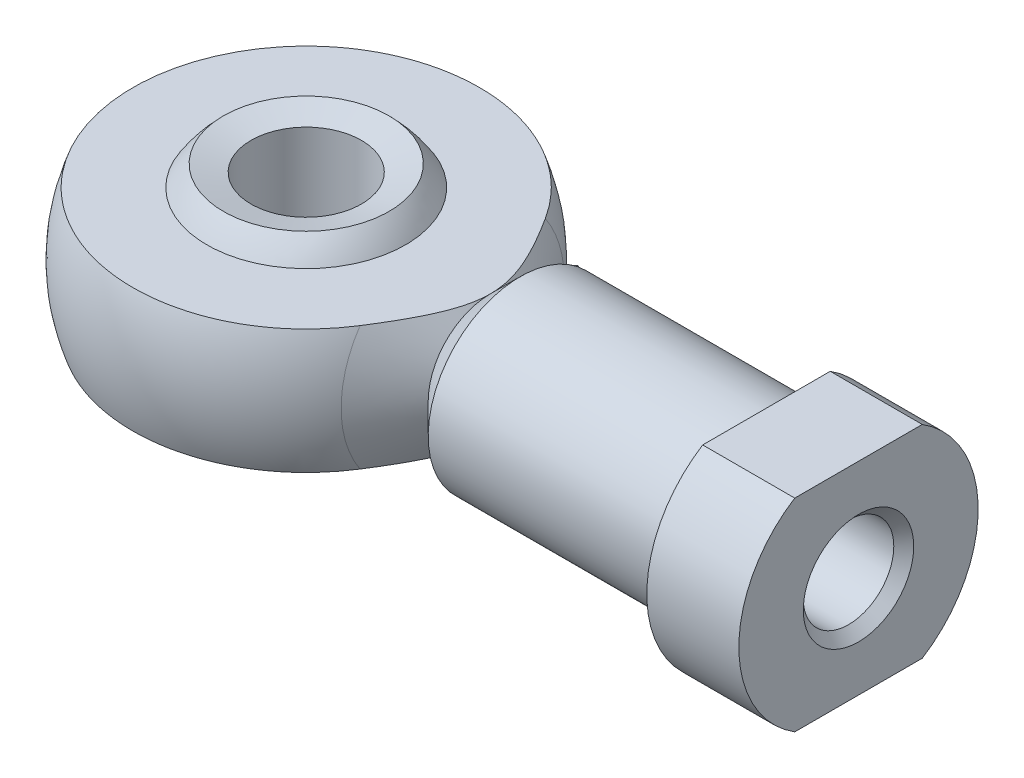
ISO-10303-21;
HEADER;
FILE_DESCRIPTION(('STEP AP214'),'2;1');
FILE_NAME('part.step','',(''),(''),'','','');
FILE_SCHEMA(('AUTOMOTIVE_DESIGN { 1 0 10303 214 1 1 1 1 }'));
ENDSEC;
DATA;
#1=APPLICATION_CONTEXT('core data for automotive mechanical design processes');
#2=APPLICATION_PROTOCOL_DEFINITION('international standard','automotive_design',2000,#1);
#3=PRODUCT_CONTEXT('',#1,'mechanical');
#4=PRODUCT('Part','Part','',(#3));
#5=PRODUCT_RELATED_PRODUCT_CATEGORY('part','',(#4));
#6=PRODUCT_DEFINITION_FORMATION('','',#4);
#7=PRODUCT_DEFINITION_CONTEXT('part definition',#1,'design');
#8=PRODUCT_DEFINITION('design','',#6,#7);
#9=PRODUCT_DEFINITION_SHAPE('','',#8);
#10=(LENGTH_UNIT() NAMED_UNIT(*) SI_UNIT(.MILLI.,.METRE.));
#11=(NAMED_UNIT(*) PLANE_ANGLE_UNIT() SI_UNIT($,.RADIAN.));
#12=(NAMED_UNIT(*) SI_UNIT($,.STERADIAN.) SOLID_ANGLE_UNIT());
#13=UNCERTAINTY_MEASURE_WITH_UNIT(LENGTH_MEASURE(1.E-05),#10,'distance_accuracy_value','');
#14=(GEOMETRIC_REPRESENTATION_CONTEXT(3) GLOBAL_UNCERTAINTY_ASSIGNED_CONTEXT((#13)) GLOBAL_UNIT_ASSIGNED_CONTEXT((#10,
#11,#12)) REPRESENTATION_CONTEXT('',''));
#15=CARTESIAN_POINT('',(0.,0.,0.));
#16=DIRECTION('',(0.,0.,1.));
#17=DIRECTION('',(1.,0.,0.));
#18=AXIS2_PLACEMENT_3D('',#15,#16,#17);
#19=CARTESIAN_POINT('',(10.8125,0.,0.));
#20=DIRECTION('',(1.,0.,0.));
#21=DIRECTION('',(0.,1.,0.));
#22=AXIS2_PLACEMENT_3D('',#19,#20,#21);
#23=CONICAL_SURFACE('',#22,4.1875,0.785398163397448);
#24=CARTESIAN_POINT('',(10.,0.,0.));
#25=DIRECTION('',(-1.,0.,0.));
#26=DIRECTION('',(0.,1.,0.));
#27=AXIS2_PLACEMENT_3D('',#24,#25,#26);
#28=CIRCLE('',#27,3.375);
#29=CARTESIAN_POINT('',(10.,-3.375,0.));
#30=VERTEX_POINT('',#29);
#31=CARTESIAN_POINT('',(10.,3.375,0.));
#32=VERTEX_POINT('',#31);
#33=EDGE_CURVE('E45',#30,#32,#28,.T.);
#34=ORIENTED_EDGE('',*,*,#33,.F.);
#35=CARTESIAN_POINT('',(10.,0.,0.));
#36=DIRECTION('',(-1.,0.,0.));
#37=DIRECTION('',(0.,1.,0.));
#38=AXIS2_PLACEMENT_3D('',#35,#36,#37);
#39=CIRCLE('',#38,3.375);
#40=EDGE_CURVE('E216',#32,#30,#39,.T.);
#41=ORIENTED_EDGE('',*,*,#40,.F.);
#42=EDGE_LOOP('',(#34,#41));
#43=FACE_BOUND('',#42,.T.);
#44=CARTESIAN_POINT('',(11.625,0.,0.));
#45=DIRECTION('',(-1.,0.,0.));
#46=DIRECTION('',(0.,1.,0.));
#47=AXIS2_PLACEMENT_3D('',#44,#45,#46);
#48=CIRCLE('',#47,5.);
#49=CARTESIAN_POINT('',(11.625,-5.,0.));
#50=VERTEX_POINT('',#49);
#51=EDGE_CURVE('E12',#50,#50,#48,.T.);
#52=ORIENTED_EDGE('',*,*,#51,.T.);
#53=EDGE_LOOP('',(#52));
#54=FACE_BOUND('',#53,.T.);
#55=ADVANCED_FACE('F19',(#43,#54),#23,.T.);
#56=CARTESIAN_POINT('',(18.3125,0.,0.));
#57=DIRECTION('',(-1.,0.,0.));
#58=DIRECTION('',(0.,1.,0.));
#59=AXIS2_PLACEMENT_3D('',#56,#57,#58);
#60=CYLINDRICAL_SURFACE('',#59,5.);
#61=ORIENTED_EDGE('',*,*,#51,.F.);
#62=EDGE_LOOP('',(#61));
#63=FACE_BOUND('',#62,.T.);
#64=CARTESIAN_POINT('',(25.,0.,0.));
#65=DIRECTION('',(-1.,0.,0.));
#66=DIRECTION('',(0.,1.,0.));
#67=AXIS2_PLACEMENT_3D('',#64,#65,#66);
#68=CIRCLE('',#67,5.);
#69=CARTESIAN_POINT('',(25.,-5.,0.));
#70=VERTEX_POINT('',#69);
#71=EDGE_CURVE('E32',#70,#70,#68,.T.);
#72=ORIENTED_EDGE('',*,*,#71,.T.);
#73=EDGE_LOOP('',(#72));
#74=FACE_BOUND('',#73,.T.);
#75=ADVANCED_FACE('F352',(#63,#74),#60,.T.);
#76=CARTESIAN_POINT('',(0.,0.,0.));
#77=DIRECTION('',(0.,0.,1.));
#78=DIRECTION('',(1.,0.,0.));
#79=AXIS2_PLACEMENT_3D('',#76,#77,#78);
#80=SPHERICAL_SURFACE('',#79,10.);
#81=CARTESIAN_POINT('',(7.95483237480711,0.654757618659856,-6.02427874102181));
#82=CARTESIAN_POINT('',(7.95003967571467,0.642819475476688,-6.03190486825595));
#83=CARTESIAN_POINT('',(7.94537217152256,0.630701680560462,-6.03932945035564));
#84=CARTESIAN_POINT('',(7.936334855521,0.606211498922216,-6.05370274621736));
#85=CARTESIAN_POINT('',(7.93196309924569,0.593841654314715,-6.06065457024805));
#86=CARTESIAN_POINT('',(7.92351696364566,0.568845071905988,-6.0740852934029));
#87=CARTESIAN_POINT('',(7.91944106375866,0.556220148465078,-6.08056661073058));
#88=CARTESIAN_POINT('',(7.91158552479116,0.530711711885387,-6.09305964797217));
#89=CARTESIAN_POINT('',(7.90780485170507,0.517829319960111,-6.09907300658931));
#90=CARTESIAN_POINT('',(7.90053827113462,0.491803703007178,-6.11063333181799));
#91=CARTESIAN_POINT('',(7.89705186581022,0.478660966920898,-6.11618108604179));
#92=CARTESIAN_POINT('',(7.8903721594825,0.452111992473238,-6.12681300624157));
#93=CARTESIAN_POINT('',(7.88717893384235,0.438705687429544,-6.13189705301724));
#94=CARTESIAN_POINT('',(7.88108253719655,0.411627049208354,-6.14160547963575));
#95=CARTESIAN_POINT('',(7.87818003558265,0.397954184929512,-6.146228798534));
#96=CARTESIAN_POINT('',(7.8726653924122,0.370337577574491,-6.15501488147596));
#97=CARTESIAN_POINT('',(7.87005453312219,0.356392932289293,-6.15917561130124));
#98=CARTESIAN_POINT('',(7.86513523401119,0.328383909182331,-6.16701129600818));
#99=CARTESIAN_POINT('',(7.86282550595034,0.314320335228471,-6.17068832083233));
#100=CARTESIAN_POINT('',(7.85851373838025,0.286145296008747,-6.17754772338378));
#101=CARTESIAN_POINT('',(7.85650943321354,0.272035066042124,-6.1807337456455));
#102=CARTESIAN_POINT('',(7.85281182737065,0.243760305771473,-6.18660956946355));
#103=CARTESIAN_POINT('',(7.85111674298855,0.229596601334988,-6.18930221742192));
#104=CARTESIAN_POINT('',(7.84803670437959,0.201210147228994,-6.19419432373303));
#105=CARTESIAN_POINT('',(7.8466505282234,0.186987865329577,-6.19639572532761));
#106=CARTESIAN_POINT('',(7.84418805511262,0.158478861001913,-6.20030695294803));
#107=CARTESIAN_POINT('',(7.8431111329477,0.144192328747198,-6.20201777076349));
#108=CARTESIAN_POINT('',(7.8412662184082,0.115549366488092,-6.20494968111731));
#109=CARTESIAN_POINT('',(7.84049822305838,0.101192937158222,-6.20617077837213));
#110=CARTESIAN_POINT('',(7.83927011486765,0.0724045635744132,-6.20812456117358));
#111=CARTESIAN_POINT('',(7.83881062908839,0.0579725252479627,-6.20885625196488));
#112=CARTESIAN_POINT('',(7.8381973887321,0.0290269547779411,-6.20983332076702));
#113=CARTESIAN_POINT('',(7.83804487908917,0.0145133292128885,-6.21007671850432));
#114=CARTESIAN_POINT('',(7.83804537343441,0.,-6.21007606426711));
#115=B_SPLINE_CURVE_WITH_KNOTS('',3,(#81,#82,#83,#84,#85,#86,#87,#88,#89,#90,#91,#92,#93,#94,
#95,#96,#97,#98,#99,#100,#101,#102,#103,#104,#105,#106,#107,#108,#109,#110,#111,#112,#113,#114),
.UNSPECIFIED.,.F.,.F.,(4,2,2,2,2,2,2,2,2,2,2,2,2,2,2,2,4),(0.,0.0448622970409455,
0.0893931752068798,0.133676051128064,0.177796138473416,0.221840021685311,0.265895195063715,
0.310049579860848,0.35439103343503,0.398536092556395,0.44233581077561,0.485874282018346,
0.529237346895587,0.572512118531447,0.615786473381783,0.659148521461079,0.702686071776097),.UNSPECIFIED.);
#116=CARTESIAN_POINT('',(7.95483237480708,0.654757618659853,-6.02427874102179));
#117=VERTEX_POINT('',#116);
#118=CARTESIAN_POINT('',(7.8380453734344,0.,-6.21007606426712));
#119=VERTEX_POINT('',#118);
#120=EDGE_CURVE('E265',#117,#119,#115,.T.);
#121=ORIENTED_EDGE('',*,*,#120,.T.);
#122=CARTESIAN_POINT('',(7.83804537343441,0.,-6.21007606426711));
#123=CARTESIAN_POINT('',(7.838044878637,-0.0145106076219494,-6.21007671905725));
#124=CARTESIAN_POINT('',(7.83819741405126,-0.029021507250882,-6.20983330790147));
#125=CARTESIAN_POINT('',(7.8388107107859,-0.0579624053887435,-6.20885623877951));
#126=CARTESIAN_POINT('',(7.83927024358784,-0.0723924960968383,-6.20812453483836));
#127=CARTESIAN_POINT('',(7.8404984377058,-0.10117775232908,-6.20617075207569));
#128=CARTESIAN_POINT('',(7.84126648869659,-0.115533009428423,-6.20494964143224));
#129=CARTESIAN_POINT('',(7.84311149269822,-0.14417440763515,-6.20201773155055));
#130=CARTESIAN_POINT('',(7.84418846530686,-0.158460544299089,-6.20030690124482));
#131=CARTESIAN_POINT('',(7.84665100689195,-0.186969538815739,-6.19639567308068));
#132=CARTESIAN_POINT('',(7.84803721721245,-0.201192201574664,-6.19419425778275));
#133=CARTESIAN_POINT('',(7.85111727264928,-0.229580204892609,-6.18930215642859));
#134=CARTESIAN_POINT('',(7.85281235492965,-0.243745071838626,-6.1866095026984));
#135=CARTESIAN_POINT('',(7.85650992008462,-0.272022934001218,-6.18073366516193));
#136=CARTESIAN_POINT('',(7.85851420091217,-0.286135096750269,-6.17754761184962));
#137=CARTESIAN_POINT('',(7.86282577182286,-0.314314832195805,-6.17068826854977));
#138=CARTESIAN_POINT('',(7.86513533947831,-0.328381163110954,-6.16701131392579));
#139=CARTESIAN_POINT('',(7.87005357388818,-0.356390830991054,-6.15917695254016));
#140=CARTESIAN_POINT('',(7.87266342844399,-0.370333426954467,-6.15501763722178));
#141=CARTESIAN_POINT('',(7.87817642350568,-0.397946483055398,-6.1462339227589));
#142=CARTESIAN_POINT('',(7.8810782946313,-0.411617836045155,-6.14161153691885));
#143=CARTESIAN_POINT('',(7.88717367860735,-0.438694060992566,-6.13190464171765));
#144=CARTESIAN_POINT('',(7.89036653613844,-0.452099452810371,-6.1268211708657));
#145=CARTESIAN_POINT('',(7.89704576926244,-0.478647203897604,-6.11619003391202));
#146=CARTESIAN_POINT('',(7.90053208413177,-0.491789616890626,-6.11064246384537));
#147=CARTESIAN_POINT('',(7.90779872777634,-0.517815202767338,-6.09908214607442));
#148=CARTESIAN_POINT('',(7.91157956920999,-0.530697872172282,-6.09306858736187));
#149=CARTESIAN_POINT('',(7.91943567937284,-0.556207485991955,-6.08057478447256));
#150=CARTESIAN_POINT('',(7.92351199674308,-0.568833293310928,-6.07409287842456));
#151=CARTESIAN_POINT('',(7.93195918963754,-0.593832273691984,-6.06066061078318));
#152=CARTESIAN_POINT('',(7.93633159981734,-0.606203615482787,-6.05370780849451));
#153=CARTESIAN_POINT('',(7.94537043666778,-0.63069743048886,-6.03933218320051));
#154=CARTESIAN_POINT('',(7.95003882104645,-0.642817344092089,-6.0319062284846));
#155=CARTESIAN_POINT('',(7.95483237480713,-0.654757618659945,-6.02427874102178));
#156=B_SPLINE_CURVE_WITH_KNOTS('',3,(#122,#123,#124,#125,#126,#127,#128,#129,#130,#131,#132,
#133,#134,#135,#136,#137,#138,#139,#140,#141,#142,#143,#144,#145,#146,#147,#148,#149,#150,#151,
#152,#153,#154,#155),.UNSPECIFIED.,.F.,.F.,(4,2,2,2,2,2,2,2,2,2,2,2,2,2,2,2,4),(0.,
0.043529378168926,0.0868855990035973,0.130156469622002,0.173430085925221,0.216794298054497,
0.260336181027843,0.304141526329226,0.348294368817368,0.392628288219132,0.436777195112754,
0.480829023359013,0.524871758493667,0.568992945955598,0.613279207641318,0.657815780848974,
0.702686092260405),.UNSPECIFIED.);
#157=CARTESIAN_POINT('',(7.95483237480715,-0.65475761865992,-6.02427874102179));
#158=VERTEX_POINT('',#157);
#159=EDGE_CURVE('E374',#119,#158,#156,.T.);
#160=ORIENTED_EDGE('',*,*,#159,.T.);
#161=CARTESIAN_POINT('',(7.95483237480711,0.,0.));
#162=DIRECTION('',(-1.,0.,0.));
#163=DIRECTION('',(0.,1.,0.));
#164=AXIS2_PLACEMENT_3D('',#161,#162,#163);
#165=CIRCLE('',#164,6.05975592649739);
#166=CARTESIAN_POINT('',(7.95483237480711,-3.375,-5.03289349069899));
#167=VERTEX_POINT('',#166);
#168=EDGE_CURVE('E378',#158,#167,#165,.T.);
#169=ORIENTED_EDGE('',*,*,#168,.T.);
#170=CARTESIAN_POINT('',(0.,-3.375,0.));
#171=DIRECTION('',(0.,1.,0.));
#172=DIRECTION('',(0.,0.,-1.));
#173=AXIS2_PLACEMENT_3D('',#170,#171,#172);
#174=CIRCLE('',#173,9.41325528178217);
#175=CARTESIAN_POINT('',(7.95483237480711,-3.375,5.03289349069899));
#176=VERTEX_POINT('',#175);
#177=EDGE_CURVE('E504',#167,#176,#174,.T.);
#178=ORIENTED_EDGE('',*,*,#177,.T.);
#179=CARTESIAN_POINT('',(7.95483237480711,0.,0.));
#180=DIRECTION('',(-1.,0.,0.));
#181=DIRECTION('',(0.,1.,0.));
#182=AXIS2_PLACEMENT_3D('',#179,#180,#181);
#183=CIRCLE('',#182,6.05975592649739);
#184=CARTESIAN_POINT('',(7.95483237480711,3.375,5.03289349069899));
#185=VERTEX_POINT('',#184);
#186=EDGE_CURVE('E207',#176,#185,#183,.T.);
#187=ORIENTED_EDGE('',*,*,#186,.T.);
#188=CARTESIAN_POINT('',(0.,3.375,0.));
#189=DIRECTION('',(0.,-1.,0.));
#190=DIRECTION('',(0.,0.,1.));
#191=AXIS2_PLACEMENT_3D('',#188,#189,#190);
#192=CIRCLE('',#191,9.41325528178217);
#193=CARTESIAN_POINT('',(7.95483237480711,3.375,-5.03289349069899));
#194=VERTEX_POINT('',#193);
#195=EDGE_CURVE('E201',#185,#194,#192,.T.);
#196=ORIENTED_EDGE('',*,*,#195,.T.);
#197=CARTESIAN_POINT('',(7.95483237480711,0.,0.));
#198=DIRECTION('',(-1.,0.,0.));
#199=DIRECTION('',(0.,1.,0.));
#200=AXIS2_PLACEMENT_3D('',#197,#198,#199);
#201=CIRCLE('',#200,6.05975592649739);
#202=EDGE_CURVE('E187',#194,#117,#201,.T.);
#203=ORIENTED_EDGE('',*,*,#202,.T.);
#204=EDGE_LOOP('',(#121,#160,#169,#178,#187,#196,#203));
#205=FACE_BOUND('',#204,.T.);
#206=ADVANCED_FACE('F204',(#205),#80,.T.);
#207=CARTESIAN_POINT('',(0.,4.29903810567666,0.));
#208=DIRECTION('',(0.,1.,0.));
#209=DIRECTION('',(1.,0.,0.));
#210=AXIS2_PLACEMENT_3D('',#207,#208,#209);
#211=CONICAL_SURFACE('',#210,3.75,1.30899693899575);
#212=CARTESIAN_POINT('',(0.,4.5,0.));
#213=DIRECTION('',(0.,1.,0.));
#214=DIRECTION('',(1.,0.,0.));
#215=AXIS2_PLACEMENT_3D('',#212,#213,#214);
#216=CIRCLE('',#215,4.5);
#217=CARTESIAN_POINT('',(-4.5,4.5,0.));
#218=VERTEX_POINT('',#217);
#219=EDGE_CURVE('E75',#218,#218,#216,.T.);
#220=ORIENTED_EDGE('',*,*,#219,.T.);
#221=EDGE_LOOP('',(#220));
#222=FACE_BOUND('',#221,.T.);
#223=CARTESIAN_POINT('',(0.,4.09807621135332,0.));
#224=DIRECTION('',(0.,1.,0.));
#225=DIRECTION('',(1.,0.,0.));
#226=AXIS2_PLACEMENT_3D('',#223,#224,#225);
#227=CIRCLE('',#226,3.);
#228=CARTESIAN_POINT('',(-3.,4.09807621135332,0.));
#229=VERTEX_POINT('',#228);
#230=EDGE_CURVE('E85',#229,#229,#227,.T.);
#231=ORIENTED_EDGE('',*,*,#230,.F.);
#232=EDGE_LOOP('',(#231));
#233=FACE_BOUND('',#232,.T.);
#234=ADVANCED_FACE('F351',(#222,#233),#211,.F.);
#235=CARTESIAN_POINT('',(0.,-4.29903810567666,0.));
#236=DIRECTION('',(0.,-1.,0.));
#237=DIRECTION('',(1.,0.,0.));
#238=AXIS2_PLACEMENT_3D('',#235,#236,#237);
#239=CONICAL_SURFACE('',#238,3.75,1.30899693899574);
#240=CARTESIAN_POINT('',(0.,-4.09834416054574,0.));
#241=DIRECTION('',(0.,1.,0.));
#242=DIRECTION('',(1.,0.,0.));
#243=AXIS2_PLACEMENT_3D('',#240,#241,#242);
#244=CIRCLE('',#243,3.001);
#245=CARTESIAN_POINT('',(-3.001,-4.09834416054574,0.));
#246=VERTEX_POINT('',#245);
#247=EDGE_CURVE('E95',#246,#246,#244,.T.);
#248=ORIENTED_EDGE('',*,*,#247,.T.);
#249=EDGE_LOOP('',(#248));
#250=FACE_BOUND('',#249,.T.);
#251=CARTESIAN_POINT('',(0.,-4.5,0.));
#252=DIRECTION('',(0.,1.,0.));
#253=DIRECTION('',(1.,0.,0.));
#254=AXIS2_PLACEMENT_3D('',#251,#252,#253);
#255=CIRCLE('',#254,4.5);
#256=CARTESIAN_POINT('',(-4.5,-4.5,0.));
#257=VERTEX_POINT('',#256);
#258=EDGE_CURVE('E481',#257,#257,#255,.T.);
#259=ORIENTED_EDGE('',*,*,#258,.F.);
#260=EDGE_LOOP('',(#259));
#261=FACE_BOUND('',#260,.T.);
#262=ADVANCED_FACE('F640',(#250,#261),#239,.F.);
#263=CARTESIAN_POINT('',(0.,4.09807621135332,0.));
#264=DIRECTION('',(0.,-1.,0.));
#265=DIRECTION('',(1.,0.,0.));
#266=AXIS2_PLACEMENT_3D('',#263,#264,#265);
#267=CYLINDRICAL_SURFACE('',#266,3.001);
#268=CARTESIAN_POINT('',(0.,4.09807621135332,0.));
#269=DIRECTION('',(0.,1.,0.));
#270=DIRECTION('',(1.,0.,0.));
#271=AXIS2_PLACEMENT_3D('',#268,#269,#270);
#272=CIRCLE('',#271,3.001);
#273=CARTESIAN_POINT('',(-3.001,4.09807621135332,0.));
#274=VERTEX_POINT('',#273);
#275=EDGE_CURVE('E309',#274,#274,#272,.T.);
#276=ORIENTED_EDGE('',*,*,#275,.T.);
#277=EDGE_LOOP('',(#276));
#278=FACE_BOUND('',#277,.T.);
#279=ORIENTED_EDGE('',*,*,#247,.F.);
#280=EDGE_LOOP('',(#279));
#281=FACE_BOUND('',#280,.T.);
#282=ADVANCED_FACE('F634',(#278,#281),#267,.F.);
#283=CARTESIAN_POINT('',(16.0902921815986,0.,0.));
#284=DIRECTION('',(1.,0.,0.));
#285=DIRECTION('',(0.,1.,0.));
#286=AXIS2_PLACEMENT_3D('',#283,#284,#285);
#287=CONICAL_SURFACE('',#286,1.22925,1.0471975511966);
#288=CARTESIAN_POINT('',(16.8,0.,0.));
#289=DIRECTION('',(-1.,0.,0.));
#290=DIRECTION('',(0.,1.,0.));
#291=AXIS2_PLACEMENT_3D('',#288,#289,#290);
#292=CIRCLE('',#291,2.4585);
#293=CARTESIAN_POINT('',(16.8,2.4585,0.));
#294=VERTEX_POINT('',#293);
#295=EDGE_CURVE('E229',#294,#294,#292,.T.);
#296=ORIENTED_EDGE('',*,*,#295,.F.);
#297=EDGE_LOOP('',(#296));
#298=FACE_BOUND('',#297,.T.);
#299=CARTESIAN_POINT('',(15.3805843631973,0.,0.));
#300=VERTEX_POINT('',#299);
#301=VERTEX_LOOP('',#300);
#302=FACE_BOUND('',#301,.T.);
#303=ADVANCED_FACE('F631',(#298,#302),#287,.F.);
#304=CARTESIAN_POINT('',(23.12925,0.,0.));
#305=DIRECTION('',(-1.,0.,0.));
#306=DIRECTION('',(0.,1.,0.));
#307=AXIS2_PLACEMENT_3D('',#304,#305,#306);
#308=CYLINDRICAL_SURFACE('',#307,2.4585);
#309=CARTESIAN_POINT('',(29.4585,0.,0.));
#310=DIRECTION('',(-1.,0.,0.));
#311=DIRECTION('',(0.,1.,0.));
#312=AXIS2_PLACEMENT_3D('',#309,#310,#311);
#313=CIRCLE('',#312,2.4585);
#314=CARTESIAN_POINT('',(29.4585,-2.4585,0.));
#315=VERTEX_POINT('',#314);
#316=EDGE_CURVE('E293',#315,#315,#313,.T.);
#317=ORIENTED_EDGE('',*,*,#316,.F.);
#318=EDGE_LOOP('',(#317));
#319=FACE_BOUND('',#318,.T.);
#320=ORIENTED_EDGE('',*,*,#295,.T.);
#321=EDGE_LOOP('',(#320));
#322=FACE_BOUND('',#321,.T.);
#323=ADVANCED_FACE('F355',(#319,#322),#308,.F.);
#324=CARTESIAN_POINT('',(29.72925,0.,0.));
#325=DIRECTION('',(1.,0.,0.));
#326=DIRECTION('',(0.,1.,0.));
#327=AXIS2_PLACEMENT_3D('',#324,#325,#326);
#328=CONICAL_SURFACE('',#327,2.72925,0.785398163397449);
#329=CARTESIAN_POINT('',(30.,0.,0.));
#330=DIRECTION('',(-1.,0.,0.));
#331=DIRECTION('',(0.,1.,0.));
#332=AXIS2_PLACEMENT_3D('',#329,#330,#331);
#333=CIRCLE('',#332,3.);
#334=CARTESIAN_POINT('',(30.,-3.,0.));
#335=VERTEX_POINT('',#334);
#336=EDGE_CURVE('E241',#335,#335,#333,.T.);
#337=ORIENTED_EDGE('',*,*,#336,.F.);
#338=EDGE_LOOP('',(#337));
#339=FACE_BOUND('',#338,.T.);
#340=ORIENTED_EDGE('',*,*,#316,.T.);
#341=EDGE_LOOP('',(#340));
#342=FACE_BOUND('',#341,.T.);
#343=ADVANCED_FACE('F390',(#339,#342),#328,.F.);
#344=CARTESIAN_POINT('',(8.273287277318,0.,-5.17139417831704));
#345=DIRECTION('',(-0.795483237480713,0.,0.60597559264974));
#346=DIRECTION('',(-0.60597559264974,0.,-0.795483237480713));
#347=AXIS2_PLACEMENT_3D('',#344,#345,#346);
#348=CYLINDRICAL_SURFACE('',#347,1.09);
#349=CARTESIAN_POINT('',(9.16051339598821,0.,-4.47702049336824));
#350=CARTESIAN_POINT('',(9.16051408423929,0.0142811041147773,-4.47701979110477));
#351=CARTESIAN_POINT('',(9.16031616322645,0.0285626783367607,-4.47721108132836));
#352=CARTESIAN_POINT('',(9.1595203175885,0.0570178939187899,-4.47798354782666));
#353=CARTESIAN_POINT('',(9.15892480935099,0.0711916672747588,-4.47856236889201));
#354=CARTESIAN_POINT('',(9.15733394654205,0.0994448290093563,-4.48011285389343));
#355=CARTESIAN_POINT('',(9.15634001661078,0.113524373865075,-4.48108311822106));
#356=CARTESIAN_POINT('',(9.15395356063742,0.14160222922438,-4.48341802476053));
#357=CARTESIAN_POINT('',(9.1525614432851,0.155600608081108,-4.4847822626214));
#358=CARTESIAN_POINT('',(9.14937951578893,0.183529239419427,-4.48790674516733));
#359=CARTESIAN_POINT('',(9.14758911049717,0.197459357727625,-4.48966758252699));
#360=CARTESIAN_POINT('',(9.14361186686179,0.225264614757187,-4.49358615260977));
#361=CARTESIAN_POINT('',(9.14142347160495,0.239139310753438,-4.49574544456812));
#362=CARTESIAN_POINT('',(9.13665028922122,0.266846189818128,-4.50046317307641));
#363=CARTESIAN_POINT('',(9.13406304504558,0.280677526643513,-4.50302408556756));
#364=CARTESIAN_POINT('',(9.12849645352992,0.308312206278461,-4.50854128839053));
#365=CARTESIAN_POINT('',(9.12551387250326,0.322114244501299,-4.51150084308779));
#366=CARTESIAN_POINT('',(9.11920333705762,0.349441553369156,-4.51777496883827));
#367=CARTESIAN_POINT('',(9.11587819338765,0.362968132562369,-4.5210866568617));
#368=CARTESIAN_POINT('',(9.10886373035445,0.389786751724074,-4.52809558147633));
#369=CARTESIAN_POINT('',(9.10517535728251,0.403079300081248,-4.53179181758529));
#370=CARTESIAN_POINT('',(9.09743871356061,0.429440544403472,-4.53957133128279));
#371=CARTESIAN_POINT('',(9.09339053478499,0.442509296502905,-4.54365451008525));
#372=CARTESIAN_POINT('',(9.08493423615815,0.468430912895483,-4.55221494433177));
#373=CARTESIAN_POINT('',(9.08052540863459,0.481283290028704,-4.55669297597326));
#374=CARTESIAN_POINT('',(9.07134877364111,0.506780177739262,-4.56604851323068));
#375=CARTESIAN_POINT('',(9.06657952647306,0.519423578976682,-4.57092762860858));
#376=CARTESIAN_POINT('',(9.05668296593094,0.54451032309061,-4.5810904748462));
#377=CARTESIAN_POINT('',(9.05155356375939,0.55695187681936,-4.58637658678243));
#378=CARTESIAN_POINT('',(9.04093634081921,0.58164067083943,-4.59736021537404));
#379=CARTESIAN_POINT('',(9.03544586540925,0.593885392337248,-4.60306082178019));
#380=CARTESIAN_POINT('',(9.02411078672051,0.618191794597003,-4.61487301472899));
#381=CARTESIAN_POINT('',(9.01826310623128,0.630250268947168,-4.62098824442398));
#382=CARTESIAN_POINT('',(9.00663481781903,0.653309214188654,-4.63319939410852));
#383=CARTESIAN_POINT('',(9.00087150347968,0.664329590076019,-4.63927415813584));
#384=CARTESIAN_POINT('',(8.98907505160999,0.686046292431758,-4.65176613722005));
#385=CARTESIAN_POINT('',(8.98304162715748,0.696742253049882,-4.65818371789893));
#386=CARTESIAN_POINT('',(8.97070898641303,0.717815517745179,-4.67136308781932));
#387=CARTESIAN_POINT('',(8.96440905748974,0.728191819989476,-4.67812581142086));
#388=CARTESIAN_POINT('',(8.9515428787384,0.748624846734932,-4.69200379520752));
#389=CARTESIAN_POINT('',(8.94497553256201,0.758679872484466,-4.69912054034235));
#390=CARTESIAN_POINT('',(8.93157510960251,0.778470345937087,-4.71371295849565));
#391=CARTESIAN_POINT('',(8.92474061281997,0.78820336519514,-4.72119061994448));
#392=CARTESIAN_POINT('',(8.91080624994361,0.807349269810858,-4.73651129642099));
#393=CARTESIAN_POINT('',(8.90370469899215,0.816758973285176,-4.74435675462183));
#394=CARTESIAN_POINT('',(8.88923602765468,0.835255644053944,-4.76042023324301));
#395=CARTESIAN_POINT('',(8.88186701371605,0.844338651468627,-4.76864110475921));
#396=CARTESIAN_POINT('',(8.86686535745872,0.862184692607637,-4.78545844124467));
#397=CARTESIAN_POINT('',(8.85923069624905,0.870943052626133,-4.79405806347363));
#398=CARTESIAN_POINT('',(8.84392082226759,0.887865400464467,-4.81139121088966));
#399=CARTESIAN_POINT('',(8.83624856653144,0.896037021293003,-4.82011988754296));
#400=CARTESIAN_POINT('',(8.82072325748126,0.911933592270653,-4.83787868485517));
#401=CARTESIAN_POINT('',(8.81286978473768,0.919657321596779,-4.84690953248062));
#402=CARTESIAN_POINT('',(8.796983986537,0.934656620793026,-4.86527626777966));
#403=CARTESIAN_POINT('',(8.78895104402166,0.941930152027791,-4.87461328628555));
#404=CARTESIAN_POINT('',(8.77270603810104,0.956021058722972,-4.89359961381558));
#405=CARTESIAN_POINT('',(8.76449319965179,0.962835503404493,-4.90325043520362));
#406=CARTESIAN_POINT('',(8.74788866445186,0.976001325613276,-4.92287022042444));
#407=CARTESIAN_POINT('',(8.73949608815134,0.982348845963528,-4.93284102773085));
#408=CARTESIAN_POINT('',(8.72253214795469,0.994573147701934,-4.95310652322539));
#409=CARTESIAN_POINT('',(8.7139598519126,1.00044511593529,-4.96340333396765));
#410=CARTESIAN_POINT('',(8.69663646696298,1.0117094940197,-4.98432638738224));
#411=CARTESIAN_POINT('',(8.68788444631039,1.01709611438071,-4.99495497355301));
#412=CARTESIAN_POINT('',(8.67020178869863,1.02738314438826,-5.01654590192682));
#413=CARTESIAN_POINT('',(8.66127027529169,1.03227682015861,-5.02751073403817));
#414=CARTESIAN_POINT('',(8.64409930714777,1.04111184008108,-5.04870579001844));
#415=CARTESIAN_POINT('',(8.63586441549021,1.0450985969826,-5.05892079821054));
#416=CARTESIAN_POINT('',(8.61934462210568,1.05258075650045,-5.07951808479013));
#417=CARTESIAN_POINT('',(8.61105966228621,1.05607538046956,-5.08990059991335));
#418=CARTESIAN_POINT('',(8.59444004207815,1.06256650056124,-5.11083512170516));
#419=CARTESIAN_POINT('',(8.58610530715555,1.0655614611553,-5.12138754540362));
#420=CARTESIAN_POINT('',(8.56938607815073,1.07104377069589,-5.14266466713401));
#421=CARTESIAN_POINT('',(8.56100152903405,1.07352877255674,-5.15338992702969));
#422=CARTESIAN_POINT('',(8.54418265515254,1.0779823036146,-5.17501482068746));
#423=CARTESIAN_POINT('',(8.53574833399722,1.07994764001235,-5.18591511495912));
#424=CARTESIAN_POINT('',(8.51882987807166,1.08335216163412,-5.20789186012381));
#425=CARTESIAN_POINT('',(8.51034584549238,1.0847872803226,-5.21896901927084));
#426=CARTESIAN_POINT('',(8.49332773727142,1.08712321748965,-5.24130069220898));
#427=CARTESIAN_POINT('',(8.48479390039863,1.08801910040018,-5.25255590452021));
#428=CARTESIAN_POINT('',(8.46767651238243,1.08926180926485,-5.27524494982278));
#429=CARTESIAN_POINT('',(8.45909337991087,1.08960277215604,-5.28667941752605));
#430=CARTESIAN_POINT('',(8.44199339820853,1.08974382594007,-5.30956795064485));
#431=CARTESIAN_POINT('',(8.43347645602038,1.08954491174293,-5.32102194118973));
#432=CARTESIAN_POINT('',(8.4165273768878,1.08861454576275,-5.3439208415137));
#433=CARTESIAN_POINT('',(8.40809506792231,1.08788460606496,-5.35536568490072));
#434=CARTESIAN_POINT('',(8.3913157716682,1.08587909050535,-5.37824570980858));
#435=CARTESIAN_POINT('',(8.38296868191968,1.08460427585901,-5.3896808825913));
#436=CARTESIAN_POINT('',(8.36635960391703,1.08150253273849,-5.41254015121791));
#437=CARTESIAN_POINT('',(8.35809762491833,1.07967554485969,-5.42396424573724));
#438=CARTESIAN_POINT('',(8.34165867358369,1.07546147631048,-5.44679961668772));
#439=CARTESIAN_POINT('',(8.33348186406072,1.07307347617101,-5.4582108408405));
#440=CARTESIAN_POINT('',(8.31721314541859,1.06772970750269,-5.48101820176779));
#441=CARTESIAN_POINT('',(8.30912159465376,1.06477213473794,-5.49241417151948));
#442=CARTESIAN_POINT('',(8.29302295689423,1.05828264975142,-5.5151885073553));
#443=CARTESIAN_POINT('',(8.28501646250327,1.05474804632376,-5.52656652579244));
#444=CARTESIAN_POINT('',(8.26908859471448,1.04709391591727,-5.54930123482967));
#445=CARTESIAN_POINT('',(8.26116809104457,1.04297079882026,-5.56065732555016));
#446=CARTESIAN_POINT('',(8.24569706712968,1.03430637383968,-5.58293140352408));
#447=CARTESIAN_POINT('',(8.2381424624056,1.02978054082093,-5.59385258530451));
#448=CARTESIAN_POINT('',(8.22316996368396,1.02022425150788,-5.61558112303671));
#449=CARTESIAN_POINT('',(8.21575217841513,1.01519341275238,-5.62638838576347));
#450=CARTESIAN_POINT('',(8.20105408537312,1.00461959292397,-5.64788456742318));
#451=CARTESIAN_POINT('',(8.19377410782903,0.99907553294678,-5.65857318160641));
#452=CARTESIAN_POINT('',(8.17935113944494,0.987471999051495,-5.67982810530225));
#453=CARTESIAN_POINT('',(8.17220872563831,0.981410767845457,-5.6903938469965));
#454=CARTESIAN_POINT('',(8.15806073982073,0.968768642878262,-5.71139844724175));
#455=CARTESIAN_POINT('',(8.15105601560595,0.962185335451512,-5.7218364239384));
#456=CARTESIAN_POINT('',(8.13718298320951,0.94849562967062,-5.74258081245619));
#457=CARTESIAN_POINT('',(8.13031581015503,0.941386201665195,-5.75288598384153));
#458=CARTESIAN_POINT('',(8.11671810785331,0.926639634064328,-5.77335905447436));
#459=CARTESIAN_POINT('',(8.10998901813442,0.918998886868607,-5.78352530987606));
#460=CARTESIAN_POINT('',(8.09666525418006,0.903190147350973,-5.80371697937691));
#461=CARTESIAN_POINT('',(8.09007230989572,0.89501806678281,-5.81374033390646));
#462=CARTESIAN_POINT('',(8.07739608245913,0.878605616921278,-5.83307127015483));
#463=CARTESIAN_POINT('',(8.07130336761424,0.870386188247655,-5.84239043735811));
#464=CARTESIAN_POINT('',(8.05932704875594,0.853531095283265,-5.86076457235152));
#465=CARTESIAN_POINT('',(8.05344325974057,0.84489581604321,-5.86981977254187));
#466=CARTESIAN_POINT('',(8.04188269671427,0.827213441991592,-5.88766312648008));
#467=CARTESIAN_POINT('',(8.03620599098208,0.818166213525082,-5.89645119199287));
#468=CARTESIAN_POINT('',(8.02505983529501,0.799659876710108,-5.91375487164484));
#469=CARTESIAN_POINT('',(8.01959072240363,0.790200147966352,-5.92227003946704));
#470=CARTESIAN_POINT('',(8.00885935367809,0.770870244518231,-5.93902299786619));
#471=CARTESIAN_POINT('',(8.00359771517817,0.760999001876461,-5.94725995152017));
#472=CARTESIAN_POINT('',(7.993281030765,0.740847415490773,-5.96345126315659));
#473=CARTESIAN_POINT('',(7.98822688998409,0.730565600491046,-5.97140436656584));
#474=CARTESIAN_POINT('',(7.97832497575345,0.709594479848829,-5.98702250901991));
#475=CARTESIAN_POINT('',(7.97347839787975,0.698903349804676,-5.99468585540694));
#476=CARTESIAN_POINT('',(7.96399105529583,0.677115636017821,-6.00971935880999));
#477=CARTESIAN_POINT('',(7.95935177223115,0.666016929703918,-6.01708737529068));
#478=CARTESIAN_POINT('',(7.95483237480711,0.654757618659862,-6.02427874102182));
#479=B_SPLINE_CURVE_WITH_KNOTS('',3,(#349,#350,#351,#352,#353,#354,#355,#356,#357,#358,#359,
#360,#361,#362,#363,#364,#365,#366,#367,#368,#369,#370,#371,#372,#373,#374,#375,#376,#377,#378,
#379,#380,#381,#382,#383,#384,#385,#386,#387,#388,#389,#390,#391,#392,#393,#394,#395,#396,#397,
#398,#399,#400,#401,#402,#403,#404,#405,#406,#407,#408,#409,#410,#411,#412,#413,#414,#415,#416,
#417,#418,#419,#420,#421,#422,#423,#424,#425,#426,#427,#428,#429,#430,#431,#432,#433,#434,#435,
#436,#437,#438,#439,#440,#441,#442,#443,#444,#445,#446,#447,#448,#449,#450,#451,#452,#453,#454,
#455,#456,#457,#458,#459,#460,#461,#462,#463,#464,#465,#466,#467,#468,#469,#470,#471,#472,#473,
#474,#475,#476,#477,#478),.UNSPECIFIED.,.F.,.F.,(4,2,2,2,2,2,2,2,2,2,2,2,2,2,2,2,2,2,2,2,2,2,2,
2,2,2,2,2,2,2,2,2,2,2,2,2,2,2,2,2,2,2,2,2,2,2,2,2,2,2,2,2,2,2,2,2,2,2,2,2,2,2,2,2,4),(0.,
0.0428413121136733,0.0854245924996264,0.127856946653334,0.170245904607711,0.21269863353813,
0.2553211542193,0.29821759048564,0.341489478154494,0.384430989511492,0.4272634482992,
0.470085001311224,0.512992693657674,0.556081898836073,0.599445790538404,0.64317487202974,
0.687356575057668,0.728868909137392,0.77042643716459,0.812103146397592,0.853972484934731,
0.89610710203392,0.93857861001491,0.981457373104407,1.02481232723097,1.06742144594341,
1.11014171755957,1.15304308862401,1.19619649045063,1.23967360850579,1.28354664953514,
1.32788811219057,1.3727705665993,1.4139010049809,1.45509580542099,1.4964149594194,
1.53792021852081,1.57967485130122,1.62174338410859,1.66419133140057,1.70708492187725,
1.74989951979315,1.79259267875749,1.8352263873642,1.87786468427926,1.92057335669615,
1.96341961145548,2.00647172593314,2.04979868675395,2.09187709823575,2.13398762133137,
2.17618877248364,2.21853951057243,2.26109895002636,2.3039260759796,2.34707946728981,
2.39061703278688,2.43212510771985,2.47359546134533,2.51507936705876,2.55662797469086,
2.5982920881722,2.64012194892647,2.68216702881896,2.72447583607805),.UNSPECIFIED.);
#480=CARTESIAN_POINT('',(9.16051339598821,0.,-4.47702049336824));
#481=VERTEX_POINT('',#480);
#482=EDGE_CURVE('E195',#481,#117,#479,.T.);
#483=ORIENTED_EDGE('',*,*,#482,.F.);
#484=CARTESIAN_POINT('',(7.95483237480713,-0.654757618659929,-6.02427874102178));
#485=CARTESIAN_POINT('',(7.95935060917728,-0.666014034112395,-6.01708922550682));
#486=CARTESIAN_POINT('',(7.96398873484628,-0.677109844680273,-6.00972307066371));
#487=CARTESIAN_POINT('',(7.97347407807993,-0.69889265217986,-5.99469280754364));
#488=CARTESIAN_POINT('',(7.97831983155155,-0.709581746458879,-5.98703081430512));
#489=CARTESIAN_POINT('',(7.98822041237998,-0.730549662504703,-5.97141488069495));
#490=CARTESIAN_POINT('',(7.99327406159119,-0.740830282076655,-5.96346260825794));
#491=CARTESIAN_POINT('',(8.00359007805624,-0.760980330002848,-5.947272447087));
#492=CARTESIAN_POINT('',(8.00885155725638,-0.770851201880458,-5.93903578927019));
#493=CARTESIAN_POINT('',(8.01958292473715,-0.790181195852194,-5.92228289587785));
#494=CARTESIAN_POINT('',(8.02505221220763,-0.799641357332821,-5.91376747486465));
#495=CARTESIAN_POINT('',(8.03619902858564,-0.818149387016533,-5.89646275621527));
#496=CARTESIAN_POINT('',(8.04187623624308,-0.827197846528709,-5.88767388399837));
#497=CARTESIAN_POINT('',(8.05343813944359,-0.844883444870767,-5.86982834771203));
#498=CARTESIAN_POINT('',(8.05932278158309,-0.853520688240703,-5.86077175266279));
#499=CARTESIAN_POINT('',(8.07130105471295,-0.870380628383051,-5.84239434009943));
#500=CARTESIAN_POINT('',(8.07739488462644,-0.878602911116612,-5.83307327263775));
#501=CARTESIAN_POINT('',(8.09006855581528,-0.895014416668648,-5.8137458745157));
#502=CARTESIAN_POINT('',(8.09665767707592,-0.903183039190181,-5.80372814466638));
#503=CARTESIAN_POINT('',(8.10997492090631,-0.91898586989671,-5.78354611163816));
#504=CARTESIAN_POINT('',(8.11670134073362,-0.926624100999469,-5.77338383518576));
#505=CARTESIAN_POINT('',(8.1302947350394,-0.941366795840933,-5.75291719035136));
#506=CARTESIAN_POINT('',(8.13716029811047,-0.948474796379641,-5.74261443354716));
#507=CARTESIAN_POINT('',(8.15103116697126,-0.962162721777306,-5.72187330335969));
#508=CARTESIAN_POINT('',(8.15803536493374,-0.968745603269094,-5.71143614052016));
#509=CARTESIAN_POINT('',(8.17218335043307,-0.981387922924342,-5.69043159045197));
#510=CARTESIAN_POINT('',(8.17932631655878,-0.987449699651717,-5.67986505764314));
#511=CARTESIAN_POINT('',(8.19375143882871,-0.999055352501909,-5.65860696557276));
#512=CARTESIAN_POINT('',(8.20103304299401,-1.00460090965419,-5.64791594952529));
#513=CARTESIAN_POINT('',(8.21573546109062,-1.01517864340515,-5.62641335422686));
#514=CARTESIAN_POINT('',(8.22315596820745,-1.02021182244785,-5.61560205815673));
#515=CARTESIAN_POINT('',(8.23813490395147,-1.02977395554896,-5.5938638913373));
#516=CARTESIAN_POINT('',(8.24569324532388,-1.03430321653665,-5.58293709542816));
#517=CARTESIAN_POINT('',(8.26116383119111,-1.04296945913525,-5.56066326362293));
#518=CARTESIAN_POINT('',(8.26908001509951,-1.04709151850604,-5.54931314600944));
#519=CARTESIAN_POINT('',(8.28500050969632,-1.05474378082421,-5.52658865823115));
#520=CARTESIAN_POINT('',(8.29300396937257,-1.05827749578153,-5.51521487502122));
#521=CARTESIAN_POINT('',(8.30909772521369,-1.06476570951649,-5.49244733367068));
#522=CARTESIAN_POINT('',(8.31718744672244,-1.06772281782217,-5.48105391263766));
#523=CARTESIAN_POINT('',(8.33345371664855,-1.07306606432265,-5.45824995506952));
#524=CARTESIAN_POINT('',(8.34162992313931,-1.07545392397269,-5.44683957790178));
#525=CARTESIAN_POINT('',(8.35806887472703,-1.07966810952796,-5.42400420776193));
#526=CARTESIAN_POINT('',(8.36633147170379,-1.08149527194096,-5.41257926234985));
#527=CARTESIAN_POINT('',(8.382942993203,-1.08459775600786,-5.38971659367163));
#528=CARTESIAN_POINT('',(8.39129192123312,-1.08587305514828,-5.37827886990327));
#529=CARTESIAN_POINT('',(8.4080761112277,-1.08787983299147,-5.35539204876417));
#530=CARTESIAN_POINT('',(8.41651148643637,-1.08861047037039,-5.34394296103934));
#531=CARTESIAN_POINT('',(8.43346788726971,-1.0895428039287,-5.32103385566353));
#532=CARTESIAN_POINT('',(8.44198909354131,-1.08974291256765,-5.30957390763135));
#533=CARTESIAN_POINT('',(8.45908906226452,-1.08960375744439,-5.28668500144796));
#534=CARTESIAN_POINT('',(8.4676678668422,-1.08926404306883,-5.27525607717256));
#535=CARTESIAN_POINT('',(8.48477784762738,-1.08802336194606,-5.2525765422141));
#536=CARTESIAN_POINT('',(8.49330861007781,-1.08712818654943,-5.24132530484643));
#537=CARTESIAN_POINT('',(8.51032179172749,-1.08479348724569,-5.21899998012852));
#538=CARTESIAN_POINT('',(8.51880397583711,-1.08335882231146,-5.20792520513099));
#539=CARTESIAN_POINT('',(8.53571996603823,-1.07995495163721,-5.18595163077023));
#540=CARTESIAN_POINT('',(8.54415367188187,-1.07798973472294,-5.17505213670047));
#541=CARTESIAN_POINT('',(8.5609725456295,-1.07353620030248,-5.15342724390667));
#542=CARTESIAN_POINT('',(8.56935771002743,-1.07105099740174,-5.1427012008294));
#543=CARTESIAN_POINT('',(8.58607940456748,-1.06556806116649,-5.12142090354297));
#544=CARTESIAN_POINT('',(8.59441598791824,-1.06257259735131,-5.11086610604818));
#545=CARTESIAN_POINT('',(8.61104053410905,-1.05608016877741,-5.08992525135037));
#546=CARTESIAN_POINT('',(8.61932856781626,-1.05258466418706,-5.07953879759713));
#547=CARTESIAN_POINT('',(8.63585576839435,-1.04510074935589,-5.05893194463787));
#548=CARTESIAN_POINT('',(8.6440949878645,-1.04111304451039,-5.04871133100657));
#549=CARTESIAN_POINT('',(8.66126606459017,-1.03228009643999,-5.02751570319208));
#550=CARTESIAN_POINT('',(8.6701934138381,-1.02738995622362,-5.01655572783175));
#551=CARTESIAN_POINT('',(8.68786891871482,-1.01710879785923,-4.99497319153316));
#552=CARTESIAN_POINT('',(8.69661794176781,-1.01172444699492,-4.98434816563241));
#553=CARTESIAN_POINT('',(8.71393654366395,-1.00046376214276,-4.96343078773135));
#554=CARTESIAN_POINT('',(8.72250704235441,-0.994593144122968,-4.95313612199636));
#555=CARTESIAN_POINT('',(8.73946859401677,-0.982370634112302,-4.93287348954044));
#556=CARTESIAN_POINT('',(8.74786056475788,-0.976023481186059,-4.92290343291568));
#557=CARTESIAN_POINT('',(8.76446509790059,-0.962857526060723,-4.90328370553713));
#558=CARTESIAN_POINT('',(8.77267852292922,-0.956042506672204,-4.89363222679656));
#559=CARTESIAN_POINT('',(8.78892592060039,-0.941949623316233,-4.87464311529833));
#560=CARTESIAN_POINT('',(8.79696064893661,-0.93467461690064,-4.86530400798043));
#561=CARTESIAN_POINT('',(8.81285121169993,-0.919671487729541,-4.84693166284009));
#562=CARTESIAN_POINT('',(8.82070764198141,-0.91194533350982,-4.83789733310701));
#563=CARTESIAN_POINT('',(8.83624016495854,-0.89604335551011,-4.82012993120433));
#564=CARTESIAN_POINT('',(8.8439166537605,-0.887868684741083,-4.81139617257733));
#565=CARTESIAN_POINT('',(8.85922716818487,-0.870948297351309,-4.79406181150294));
#566=CARTESIAN_POINT('',(8.86685840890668,-0.862195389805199,-4.78546577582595));
#567=CARTESIAN_POINT('',(8.88185415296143,-0.8443584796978,-4.76865473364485));
#568=CARTESIAN_POINT('',(8.88922065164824,-0.835279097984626,-4.76043660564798));
#569=CARTESIAN_POINT('',(8.90368533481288,-0.816788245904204,-4.7443775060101));
#570=CARTESIAN_POINT('',(8.91078538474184,-0.80738067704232,-4.73653372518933));
#571=CARTESIAN_POINT('',(8.92471776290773,-0.788237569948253,-4.721215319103));
#572=CARTESIAN_POINT('',(8.93155174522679,-0.778505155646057,-4.71373829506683));
#573=CARTESIAN_POINT('',(8.94495216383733,-0.75871447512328,-4.69914602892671));
#574=CARTESIAN_POINT('',(8.95151998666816,-0.748658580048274,-4.69202884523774));
#575=CARTESIAN_POINT('',(8.96438815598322,-0.728222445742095,-4.67814881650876));
#576=CARTESIAN_POINT('',(8.97068956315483,-0.717843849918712,-4.67138453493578));
#577=CARTESIAN_POINT('',(8.98302615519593,-0.696764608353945,-4.65820091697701));
#578=CARTESIAN_POINT('',(8.98906201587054,-0.686064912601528,-4.65178069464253));
#579=CARTESIAN_POINT('',(9.00086450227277,-0.664339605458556,-4.63928201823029));
#580=CARTESIAN_POINT('',(9.00663137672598,-0.65331431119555,-4.63320324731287));
#581=CARTESIAN_POINT('',(9.01826062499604,-0.63025702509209,-4.62099059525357));
#582=CARTESIAN_POINT('',(9.02410599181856,-0.618205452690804,-4.61487752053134));
#583=CARTESIAN_POINT('',(9.03543702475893,-0.593910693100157,-4.6030692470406));
#584=CARTESIAN_POINT('',(9.04092572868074,-0.581670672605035,-4.59737044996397));
#585=CARTESIAN_POINT('',(9.0515401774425,-0.556989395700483,-4.58638972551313));
#586=CARTESIAN_POINT('',(9.05666853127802,-0.544550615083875,-4.58110476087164));
#587=CARTESIAN_POINT('',(9.06656372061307,-0.519467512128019,-4.57094351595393));
#588=CARTESIAN_POINT('',(9.07133259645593,-0.506824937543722,-4.56606490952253));
#589=CARTESIAN_POINT('',(9.08050922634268,-0.481327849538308,-4.55670963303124));
#590=CARTESIAN_POINT('',(9.08491836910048,-0.468474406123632,-4.55223141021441));
#591=CARTESIAN_POINT('',(9.09337604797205,-0.442548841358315,-4.54366977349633));
#592=CARTESIAN_POINT('',(9.09742523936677,-0.429477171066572,-4.53958564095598));
#593=CARTESIAN_POINT('',(9.1051646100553,-0.403108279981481,-4.53180341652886));
#594=CARTESIAN_POINT('',(9.10885464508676,-0.389810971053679,-4.52810547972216));
#595=CARTESIAN_POINT('',(9.11587331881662,-0.362981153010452,-4.52109204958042));
#596=CARTESIAN_POINT('',(9.11920095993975,-0.349448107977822,-4.51777761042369));
#597=CARTESIAN_POINT('',(9.12551381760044,-0.32211824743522,-4.51150061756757));
#598=CARTESIAN_POINT('',(9.12849650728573,-0.308320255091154,-4.50854065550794));
#599=CARTESIAN_POINT('',(9.13406318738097,-0.280692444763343,-4.50302295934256));
#600=CARTESIAN_POINT('',(9.13665038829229,-0.266863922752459,-4.50046198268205));
#601=CARTESIAN_POINT('',(9.14142354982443,-0.239161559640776,-4.49574415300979));
#602=CARTESIAN_POINT('',(9.14361193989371,-0.225288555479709,-4.4935848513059));
#603=CARTESIAN_POINT('',(9.14758919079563,-0.197485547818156,-4.48966632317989));
#604=CARTESIAN_POINT('',(9.14937957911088,-0.183555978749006,-4.48790556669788));
#605=CARTESIAN_POINT('',(9.15256150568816,-0.15562732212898,-4.48478125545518));
#606=CARTESIAN_POINT('',(9.15395360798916,-0.141628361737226,-4.48341713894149));
#607=CARTESIAN_POINT('',(9.1563400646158,-0.113548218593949,-4.48108245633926));
#608=CARTESIAN_POINT('',(9.15733397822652,-0.0994669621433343,-4.48011232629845));
#609=CARTESIAN_POINT('',(9.15892484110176,-0.071209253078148,-4.47856205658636));
#610=CARTESIAN_POINT('',(9.15952033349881,-0.0570326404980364,-4.47798334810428));
#611=CARTESIAN_POINT('',(9.16031617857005,-0.0285706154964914,-4.47721102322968));
#612=CARTESIAN_POINT('',(9.1605140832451,-0.014285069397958,-4.47701979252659));
#613=CARTESIAN_POINT('',(9.16051339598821,0.,-4.47702049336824));
#614=B_SPLINE_CURVE_WITH_KNOTS('',3,(#484,#485,#486,#487,#488,#489,#490,#491,#492,#493,#494,
#495,#496,#497,#498,#499,#500,#501,#502,#503,#504,#505,#506,#507,#508,#509,#510,#511,#512,#513,
#514,#515,#516,#517,#518,#519,#520,#521,#522,#523,#524,#525,#526,#527,#528,#529,#530,#531,#532,
#533,#534,#535,#536,#537,#538,#539,#540,#541,#542,#543,#544,#545,#546,#547,#548,#549,#550,#551,
#552,#553,#554,#555,#556,#557,#558,#559,#560,#561,#562,#563,#564,#565,#566,#567,#568,#569,#570,
#571,#572,#573,#574,#575,#576,#577,#578,#579,#580,#581,#582,#583,#584,#585,#586,#587,#588,#589,
#590,#591,#592,#593,#594,#595,#596,#597,#598,#599,#600,#601,#602,#603,#604,#605,#606,#607,#608,
#609,#610,#611,#612,#613),.UNSPECIFIED.,.F.,.F.,(4,2,2,2,2,2,2,2,2,2,2,2,2,2,2,2,2,2,2,2,2,2,2,
2,2,2,2,2,2,2,2,2,2,2,2,2,2,2,2,2,2,2,2,2,2,2,2,2,2,2,2,2,2,2,2,2,2,2,2,2,2,2,2,2,4),(0.,
0.0422979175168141,0.0843352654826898,0.126160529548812,0.167823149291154,0.209373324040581,
0.250861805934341,0.292339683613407,0.33385816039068,0.377373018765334,0.420510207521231,
0.463327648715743,0.505883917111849,0.548237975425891,0.590448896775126,0.632575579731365,
0.674676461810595,0.717981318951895,0.761017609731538,0.803854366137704,0.84655988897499,
0.889201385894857,0.931844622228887,0.974553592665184,1.01739022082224,1.06026262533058,
1.10269537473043,1.14475476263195,1.18650634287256,1.22801465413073,1.26934294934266,
1.31055293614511,1.35170453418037,1.39656537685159,1.44089133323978,1.48475505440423,
1.52822908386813,1.57138563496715,1.61429635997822,1.65703211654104,1.69966273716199,
1.74299594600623,1.78585915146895,1.82832135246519,1.87045293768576,1.91232550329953,
1.95401164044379,1.99558469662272,2.03711851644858,2.08127781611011,2.12499090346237,
2.16834525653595,2.21143138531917,2.25434242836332,2.29717368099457,2.34002206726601,
2.38298557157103,2.42624615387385,2.46913441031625,2.51175196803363,2.55420302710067,
2.59659366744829,2.63903109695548,2.68162286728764,2.72447608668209),.UNSPECIFIED.);
#615=EDGE_CURVE('E222',#158,#481,#614,.T.);
#616=ORIENTED_EDGE('',*,*,#615,.F.);
#617=ORIENTED_EDGE('',*,*,#159,.F.);
#618=ORIENTED_EDGE('',*,*,#120,.F.);
#619=EDGE_LOOP('',(#483,#616,#617,#618));
#620=FACE_BOUND('',#619,.T.);
#621=CARTESIAN_POINT('',(8.95342544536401,0.,-5.68950331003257));
#622=DIRECTION('',(-0.795483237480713,0.,0.60597559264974));
#623=DIRECTION('',(-0.60597559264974,0.,-0.795483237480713));
#624=AXIS2_PLACEMENT_3D('',#621,#622,#623);
#625=CIRCLE('',#624,1.09);
#626=CARTESIAN_POINT('',(9.61393884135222,0.,-4.82242658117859));
#627=VERTEX_POINT('',#626);
#628=EDGE_CURVE('E282',#627,#627,#625,.T.);
#629=ORIENTED_EDGE('',*,*,#628,.T.);
#630=EDGE_LOOP('',(#629));
#631=FACE_BOUND('',#630,.T.);
#632=ADVANCED_FACE('F380',(#620,#631),#348,.T.);
#633=CARTESIAN_POINT('',(8.6231687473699,0.,-6.12304167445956));
#634=DIRECTION('',(0.795483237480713,0.,-0.60597559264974));
#635=DIRECTION('',(0.,-1.,0.));
#636=AXIS2_PLACEMENT_3D('',#633,#634,#635);
#637=PLANE('',#636);
#638=ORIENTED_EDGE('',*,*,#628,.F.);
#639=EDGE_LOOP('',(#638));
#640=FACE_BOUND('',#639,.T.);
#641=ADVANCED_FACE('F389',(#640),#637,.T.);
#642=CARTESIAN_POINT('',(8.97741618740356,0.,0.));
#643=DIRECTION('',(-1.,0.,0.));
#644=DIRECTION('',(0.,1.,0.));
#645=AXIS2_PLACEMENT_3D('',#642,#643,#644);
#646=CONICAL_SURFACE('',#645,4.71737796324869,0.919804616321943);
#647=ORIENTED_EDGE('',*,*,#615,.T.);
#648=ORIENTED_EDGE('',*,*,#482,.T.);
#649=ORIENTED_EDGE('',*,*,#202,.F.);
#650=CARTESIAN_POINT('',(7.95483237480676,3.375,-5.03289349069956));
#651=CARTESIAN_POINT('',(10.,3.375,-1.80036618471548));
#652=CARTESIAN_POINT('',(10.,3.375,0.));
#653=(BOUNDED_CURVE() B_SPLINE_CURVE(2,(#650,#651,#652),.UNSPECIFIED.,.F.,
.F.) B_SPLINE_CURVE_WITH_KNOTS((3,3),(1.9160523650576E-12,5.48417894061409),
.UNSPECIFIED.) CURVE() GEOMETRIC_REPRESENTATION_ITEM() RATIONAL_B_SPLINE_CURVE((1.,
1.18226123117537,1.)) REPRESENTATION_ITEM(''));
#654=EDGE_CURVE('E193',#194,#32,#653,.T.);
#655=ORIENTED_EDGE('',*,*,#654,.T.);
#656=ORIENTED_EDGE('',*,*,#40,.T.);
#657=CARTESIAN_POINT('',(10.,-3.375,0.));
#658=CARTESIAN_POINT('',(10.,-3.375,-1.80036618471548));
#659=CARTESIAN_POINT('',(7.95483237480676,-3.375,-5.03289349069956));
#660=(BOUNDED_CURVE() B_SPLINE_CURVE(2,(#657,#658,#659),.UNSPECIFIED.,.F.,
.F.) B_SPLINE_CURVE_WITH_KNOTS((3,3),(5.48417894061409,10.9683578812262),
.UNSPECIFIED.) CURVE() GEOMETRIC_REPRESENTATION_ITEM() RATIONAL_B_SPLINE_CURVE((1.,
1.18226123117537,1.)) REPRESENTATION_ITEM(''));
#661=EDGE_CURVE('E223',#30,#167,#660,.T.);
#662=ORIENTED_EDGE('',*,*,#661,.T.);
#663=ORIENTED_EDGE('',*,*,#168,.F.);
#664=EDGE_LOOP('',(#647,#648,#649,#655,#656,#662,#663));
#665=FACE_BOUND('',#664,.T.);
#666=ADVANCED_FACE('F190',(#665),#646,.T.);
#667=CARTESIAN_POINT('',(0.,4.09807621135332,0.));
#668=DIRECTION('',(0.,1.,0.));
#669=DIRECTION('',(1.,0.,0.));
#670=AXIS2_PLACEMENT_3D('',#667,#668,#669);
#671=PLANE('',#670);
#672=ORIENTED_EDGE('',*,*,#275,.F.);
#673=EDGE_LOOP('',(#672));
#674=FACE_BOUND('',#673,.T.);
#675=ORIENTED_EDGE('',*,*,#230,.T.);
#676=EDGE_LOOP('',(#675));
#677=FACE_BOUND('',#676,.T.);
#678=ADVANCED_FACE('F423',(#674,#677),#671,.F.);
#679=CARTESIAN_POINT('',(0.,0.,0.));
#680=DIRECTION('',(0.,0.,1.));
#681=DIRECTION('',(1.,0.,0.));
#682=AXIS2_PLACEMENT_3D('',#679,#680,#681);
#683=SPHERICAL_SURFACE('',#682,6.36396103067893);
#684=CARTESIAN_POINT('',(0.,0.,0.));
#685=DIRECTION('',(0.,1.,0.));
#686=DIRECTION('',(0.,0.,1.));
#687=AXIS2_PLACEMENT_3D('',#684,#685,#686);
#688=SPHERICAL_SURFACE('',#687,6.36396103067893);
#689=CARTESIAN_POINT('',(0.,-3.375,0.));
#690=DIRECTION('',(0.,1.,0.));
#691=DIRECTION('',(0.,0.,1.));
#692=AXIS2_PLACEMENT_3D('',#689,#690,#691);
#693=CIRCLE('',#692,5.39531046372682);
#694=CARTESIAN_POINT('',(0.,-3.375,5.39531046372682));
#695=VERTEX_POINT('',#694);
#696=EDGE_CURVE('E486',#695,#695,#693,.T.);
#697=ORIENTED_EDGE('',*,*,#696,.F.);
#698=EDGE_LOOP('',(#697));
#699=FACE_BOUND('',#698,.T.);
#700=ORIENTED_EDGE('',*,*,#258,.T.);
#701=EDGE_LOOP('',(#700));
#702=FACE_BOUND('',#701,.T.);
#703=ADVANCED_FACE('F462',(#699,#702),#688,.T.);
#704=CARTESIAN_POINT('',(0.,0.,0.));
#705=DIRECTION('',(0.,0.,1.));
#706=DIRECTION('',(1.,0.,0.));
#707=AXIS2_PLACEMENT_3D('',#704,#705,#706);
#708=SPHERICAL_SURFACE('',#707,6.36396103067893);
#709=CARTESIAN_POINT('',(0.,0.,0.));
#710=DIRECTION('',(0.,-1.,0.));
#711=DIRECTION('',(0.,0.,-1.));
#712=AXIS2_PLACEMENT_3D('',#709,#710,#711);
#713=SPHERICAL_SURFACE('',#712,6.36396103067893);
#714=CARTESIAN_POINT('',(0.,3.375,0.));
#715=DIRECTION('',(0.,-1.,0.));
#716=DIRECTION('',(0.,0.,-1.));
#717=AXIS2_PLACEMENT_3D('',#714,#715,#716);
#718=CIRCLE('',#717,5.39531046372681);
#719=CARTESIAN_POINT('',(0.,3.375,-5.39531046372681));
#720=VERTEX_POINT('',#719);
#721=EDGE_CURVE('E297',#720,#720,#718,.T.);
#722=ORIENTED_EDGE('',*,*,#721,.F.);
#723=EDGE_LOOP('',(#722));
#724=FACE_BOUND('',#723,.T.);
#725=ORIENTED_EDGE('',*,*,#219,.F.);
#726=EDGE_LOOP('',(#725));
#727=FACE_BOUND('',#726,.T.);
#728=ADVANCED_FACE('F473',(#724,#727),#713,.T.);
#729=CARTESIAN_POINT('',(36.,-5.5,-11.));
#730=DIRECTION('',(0.,1.,0.));
#731=DIRECTION('',(1.,0.,0.));
#732=AXIS2_PLACEMENT_3D('',#729,#730,#731);
#733=PLANE('',#732);
#734=DIRECTION('',(0.,0.,-1.));
#735=VECTOR('',#734,1.);
#736=CARTESIAN_POINT('',(30.,-5.5,-5.5));
#737=LINE('',#736,#735);
#738=CARTESIAN_POINT('',(30.,-5.5,3.46410161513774));
#739=VERTEX_POINT('',#738);
#740=CARTESIAN_POINT('',(30.,-5.5,-3.46410161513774));
#741=VERTEX_POINT('',#740);
#742=EDGE_CURVE('E281',#739,#741,#737,.T.);
#743=ORIENTED_EDGE('',*,*,#742,.F.);
#744=DIRECTION('',(1.,0.,0.));
#745=VECTOR('',#744,1.);
#746=CARTESIAN_POINT('',(27.5,-5.5,3.46410161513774));
#747=LINE('',#746,#745);
#748=CARTESIAN_POINT('',(25.,-5.5,3.46410161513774));
#749=VERTEX_POINT('',#748);
#750=EDGE_CURVE('E266',#749,#739,#747,.T.);
#751=ORIENTED_EDGE('',*,*,#750,.F.);
#752=DIRECTION('',(0.,0.,1.));
#753=VECTOR('',#752,1.);
#754=CARTESIAN_POINT('',(25.,-5.5,-5.5));
#755=LINE('',#754,#753);
#756=CARTESIAN_POINT('',(25.,-5.5,-3.46410161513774));
#757=VERTEX_POINT('',#756);
#758=EDGE_CURVE('E239',#757,#749,#755,.T.);
#759=ORIENTED_EDGE('',*,*,#758,.F.);
#760=DIRECTION('',(-1.,0.,0.));
#761=VECTOR('',#760,1.);
#762=CARTESIAN_POINT('',(27.5,-5.5,-3.46410161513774));
#763=LINE('',#762,#761);
#764=EDGE_CURVE('E247',#741,#757,#763,.T.);
#765=ORIENTED_EDGE('',*,*,#764,.F.);
#766=EDGE_LOOP('',(#743,#751,#759,#765));
#767=FACE_BOUND('',#766,.T.);
#768=ADVANCED_FACE('F466',(#767),#733,.F.);
#769=CARTESIAN_POINT('',(25.,5.75,0.));
#770=DIRECTION('',(-1.,0.,0.));
#771=DIRECTION('',(0.,0.,1.));
#772=AXIS2_PLACEMENT_3D('',#769,#770,#771);
#773=PLANE('',#772);
#774=ORIENTED_EDGE('',*,*,#758,.T.);
#775=CARTESIAN_POINT('',(25.,0.,0.));
#776=DIRECTION('',(-1.,0.,0.));
#777=DIRECTION('',(0.,1.,0.));
#778=AXIS2_PLACEMENT_3D('',#775,#776,#777);
#779=CIRCLE('',#778,6.5);
#780=CARTESIAN_POINT('',(25.,5.5,3.46410161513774));
#781=VERTEX_POINT('',#780);
#782=EDGE_CURVE('E232',#749,#781,#779,.T.);
#783=ORIENTED_EDGE('',*,*,#782,.T.);
#784=DIRECTION('',(0.,0.,-1.));
#785=VECTOR('',#784,1.);
#786=CARTESIAN_POINT('',(25.,5.5,5.5));
#787=LINE('',#786,#785);
#788=CARTESIAN_POINT('',(25.,5.5,-3.46410161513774));
#789=VERTEX_POINT('',#788);
#790=EDGE_CURVE('E240',#781,#789,#787,.T.);
#791=ORIENTED_EDGE('',*,*,#790,.T.);
#792=CARTESIAN_POINT('',(25.,0.,0.));
#793=DIRECTION('',(-1.,0.,0.));
#794=DIRECTION('',(0.,1.,0.));
#795=AXIS2_PLACEMENT_3D('',#792,#793,#794);
#796=CIRCLE('',#795,6.5);
#797=EDGE_CURVE('E150',#789,#757,#796,.T.);
#798=ORIENTED_EDGE('',*,*,#797,.T.);
#799=EDGE_LOOP('',(#774,#783,#791,#798));
#800=FACE_BOUND('',#799,.T.);
#801=ORIENTED_EDGE('',*,*,#71,.F.);
#802=EDGE_LOOP('',(#801));
#803=FACE_BOUND('',#802,.T.);
#804=ADVANCED_FACE('F464',(#800,#803),#773,.T.);
#805=CARTESIAN_POINT('',(27.5,0.,0.));
#806=DIRECTION('',(-1.,0.,0.));
#807=DIRECTION('',(0.,1.,0.));
#808=AXIS2_PLACEMENT_3D('',#805,#806,#807);
#809=CYLINDRICAL_SURFACE('',#808,6.5);
#810=ORIENTED_EDGE('',*,*,#750,.T.);
#811=CARTESIAN_POINT('',(30.,0.,0.));
#812=DIRECTION('',(-1.,0.,0.));
#813=DIRECTION('',(0.,1.,0.));
#814=AXIS2_PLACEMENT_3D('',#811,#812,#813);
#815=CIRCLE('',#814,6.5);
#816=CARTESIAN_POINT('',(30.,5.5,3.46410161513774));
#817=VERTEX_POINT('',#816);
#818=EDGE_CURVE('E484',#739,#817,#815,.T.);
#819=ORIENTED_EDGE('',*,*,#818,.T.);
#820=DIRECTION('',(-1.,0.,0.));
#821=VECTOR('',#820,1.);
#822=CARTESIAN_POINT('',(27.5,5.5,3.46410161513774));
#823=LINE('',#822,#821);
#824=EDGE_CURVE('E160',#817,#781,#823,.T.);
#825=ORIENTED_EDGE('',*,*,#824,.T.);
#826=ORIENTED_EDGE('',*,*,#782,.F.);
#827=EDGE_LOOP('',(#810,#819,#825,#826));
#828=FACE_BOUND('',#827,.T.);
#829=ADVANCED_FACE('F353',(#828),#809,.T.);
#830=CARTESIAN_POINT('',(36.,5.5,11.));
#831=DIRECTION('',(0.,-1.,0.));
#832=DIRECTION('',(0.,0.,-1.));
#833=AXIS2_PLACEMENT_3D('',#830,#831,#832);
#834=PLANE('',#833);
#835=DIRECTION('',(0.,0.,1.));
#836=VECTOR('',#835,1.);
#837=CARTESIAN_POINT('',(30.,5.5,5.5));
#838=LINE('',#837,#836);
#839=CARTESIAN_POINT('',(30.,5.5,-3.46410161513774));
#840=VERTEX_POINT('',#839);
#841=EDGE_CURVE('E246',#840,#817,#838,.T.);
#842=ORIENTED_EDGE('',*,*,#841,.F.);
#843=DIRECTION('',(1.,0.,0.));
#844=VECTOR('',#843,1.);
#845=CARTESIAN_POINT('',(27.5,5.5,-3.46410161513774));
#846=LINE('',#845,#844);
#847=EDGE_CURVE('E288',#789,#840,#846,.T.);
#848=ORIENTED_EDGE('',*,*,#847,.F.);
#849=ORIENTED_EDGE('',*,*,#790,.F.);
#850=ORIENTED_EDGE('',*,*,#824,.F.);
#851=EDGE_LOOP('',(#842,#848,#849,#850));
#852=FACE_BOUND('',#851,.T.);
#853=ADVANCED_FACE('F392',(#852),#834,.F.);
#854=CARTESIAN_POINT('',(10.,-3.375,10.));
#855=DIRECTION('',(0.,1.,0.));
#856=DIRECTION('',(1.,0.,0.));
#857=AXIS2_PLACEMENT_3D('',#854,#855,#856);
#858=PLANE('',#857);
#859=ORIENTED_EDGE('',*,*,#661,.F.);
#860=CARTESIAN_POINT('',(7.95483237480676,-3.375,5.03289349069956));
#861=CARTESIAN_POINT('',(10.,-3.375,1.80036618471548));
#862=CARTESIAN_POINT('',(10.,-3.375,0.));
#863=(BOUNDED_CURVE() B_SPLINE_CURVE(2,(#860,#861,#862),.UNSPECIFIED.,.F.,
.F.) B_SPLINE_CURVE_WITH_KNOTS((3,3),(1.9160523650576E-12,5.48417894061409),
.UNSPECIFIED.) CURVE() GEOMETRIC_REPRESENTATION_ITEM() RATIONAL_B_SPLINE_CURVE((1.,
1.18226123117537,1.)) REPRESENTATION_ITEM(''));
#864=EDGE_CURVE('E326',#176,#30,#863,.T.);
#865=ORIENTED_EDGE('',*,*,#864,.F.);
#866=ORIENTED_EDGE('',*,*,#177,.F.);
#867=EDGE_LOOP('',(#859,#865,#866));
#868=FACE_BOUND('',#867,.T.);
#869=ORIENTED_EDGE('',*,*,#696,.T.);
#870=EDGE_LOOP('',(#869));
#871=FACE_BOUND('',#870,.T.);
#872=ADVANCED_FACE('F391',(#868,#871),#858,.F.);
#873=CARTESIAN_POINT('',(-10.,3.375,10.));
#874=DIRECTION('',(0.,-1.,0.));
#875=DIRECTION('',(0.,0.,-1.));
#876=AXIS2_PLACEMENT_3D('',#873,#874,#875);
#877=PLANE('',#876);
#878=CARTESIAN_POINT('',(10.,3.375,0.));
#879=CARTESIAN_POINT('',(10.,3.375,1.80036618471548));
#880=CARTESIAN_POINT('',(7.95483237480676,3.375,5.03289349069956));
#881=(BOUNDED_CURVE() B_SPLINE_CURVE(2,(#878,#879,#880),.UNSPECIFIED.,.F.,
.F.) B_SPLINE_CURVE_WITH_KNOTS((3,3),(5.48417894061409,10.9683578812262),
.UNSPECIFIED.) CURVE() GEOMETRIC_REPRESENTATION_ITEM() RATIONAL_B_SPLINE_CURVE((1.,
1.18226123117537,1.)) REPRESENTATION_ITEM(''));
#882=EDGE_CURVE('E214',#32,#185,#881,.T.);
#883=ORIENTED_EDGE('',*,*,#882,.F.);
#884=ORIENTED_EDGE('',*,*,#654,.F.);
#885=ORIENTED_EDGE('',*,*,#195,.F.);
#886=EDGE_LOOP('',(#883,#884,#885));
#887=FACE_BOUND('',#886,.T.);
#888=ORIENTED_EDGE('',*,*,#721,.T.);
#889=EDGE_LOOP('',(#888));
#890=FACE_BOUND('',#889,.T.);
#891=ADVANCED_FACE('F212',(#887,#890),#877,.F.);
#892=CARTESIAN_POINT('',(8.97741618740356,0.,0.));
#893=DIRECTION('',(-1.,0.,0.));
#894=DIRECTION('',(0.,1.,0.));
#895=AXIS2_PLACEMENT_3D('',#892,#893,#894);
#896=CONICAL_SURFACE('',#895,4.71737796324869,0.919804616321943);
#897=ORIENTED_EDGE('',*,*,#864,.T.);
#898=ORIENTED_EDGE('',*,*,#33,.T.);
#899=ORIENTED_EDGE('',*,*,#882,.T.);
#900=ORIENTED_EDGE('',*,*,#186,.F.);
#901=EDGE_LOOP('',(#897,#898,#899,#900));
#902=FACE_BOUND('',#901,.T.);
#903=ADVANCED_FACE('F21',(#902),#896,.T.);
#904=CARTESIAN_POINT('',(30.,3.25,0.));
#905=DIRECTION('',(1.,0.,0.));
#906=DIRECTION('',(0.,1.,0.));
#907=AXIS2_PLACEMENT_3D('',#904,#905,#906);
#908=PLANE('',#907);
#909=ORIENTED_EDGE('',*,*,#742,.T.);
#910=CARTESIAN_POINT('',(30.,0.,0.));
#911=DIRECTION('',(-1.,0.,0.));
#912=DIRECTION('',(0.,1.,0.));
#913=AXIS2_PLACEMENT_3D('',#910,#911,#912);
#914=CIRCLE('',#913,6.5);
#915=EDGE_CURVE('E284',#840,#741,#914,.T.);
#916=ORIENTED_EDGE('',*,*,#915,.F.);
#917=ORIENTED_EDGE('',*,*,#841,.T.);
#918=ORIENTED_EDGE('',*,*,#818,.F.);
#919=EDGE_LOOP('',(#909,#916,#917,#918));
#920=FACE_BOUND('',#919,.T.);
#921=ORIENTED_EDGE('',*,*,#336,.T.);
#922=EDGE_LOOP('',(#921));
#923=FACE_BOUND('',#922,.T.);
#924=ADVANCED_FACE('F614',(#920,#923),#908,.T.);
#925=CARTESIAN_POINT('',(27.5,0.,0.));
#926=DIRECTION('',(-1.,0.,0.));
#927=DIRECTION('',(0.,1.,0.));
#928=AXIS2_PLACEMENT_3D('',#925,#926,#927);
#929=CYLINDRICAL_SURFACE('',#928,6.5);
#930=ORIENTED_EDGE('',*,*,#764,.T.);
#931=ORIENTED_EDGE('',*,*,#797,.F.);
#932=ORIENTED_EDGE('',*,*,#847,.T.);
#933=ORIENTED_EDGE('',*,*,#915,.T.);
#934=EDGE_LOOP('',(#930,#931,#932,#933));
#935=FACE_BOUND('',#934,.T.);
#936=ADVANCED_FACE('F424',(#935),#929,.T.);
#937=CLOSED_SHELL('',(#55,#75,#206,#234,#262,#282,#303,#323,#343,#632,#641,#666,#678,#703,#728,
#768,#804,#829,#853,#872,#891,#903,#924,#936));
#938=MANIFOLD_SOLID_BREP('B1',#937);
#939=ADVANCED_BREP_SHAPE_REPRESENTATION('',(#18,#938),#14);
#940=SHAPE_DEFINITION_REPRESENTATION(#9,#939);
ENDSEC;
END-ISO-10303-21;
